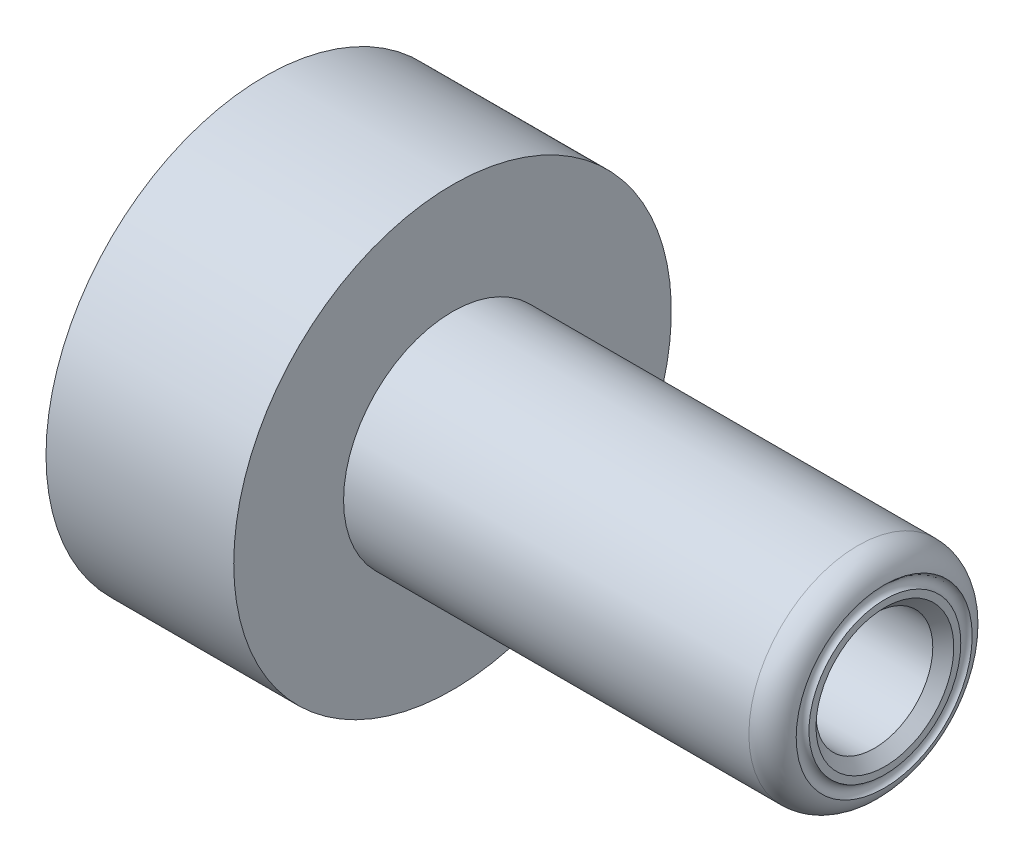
ISO-10303-21;
HEADER;
FILE_DESCRIPTION(('STEP AP214'),'2;1');
FILE_NAME('part.step','',(''),(''),'','','');
FILE_SCHEMA(('AUTOMOTIVE_DESIGN { 1 0 10303 214 1 1 1 1 }'));
ENDSEC;
DATA;
#1=APPLICATION_CONTEXT('core data for automotive mechanical design processes');
#2=APPLICATION_PROTOCOL_DEFINITION('international standard','automotive_design',2000,#1);
#3=PRODUCT_CONTEXT('',#1,'mechanical');
#4=PRODUCT('Part','Part','',(#3));
#5=PRODUCT_RELATED_PRODUCT_CATEGORY('part','',(#4));
#6=PRODUCT_DEFINITION_FORMATION('','',#4);
#7=PRODUCT_DEFINITION_CONTEXT('part definition',#1,'design');
#8=PRODUCT_DEFINITION('design','',#6,#7);
#9=PRODUCT_DEFINITION_SHAPE('','',#8);
#10=(LENGTH_UNIT() NAMED_UNIT(*) SI_UNIT(.MILLI.,.METRE.));
#11=(NAMED_UNIT(*) PLANE_ANGLE_UNIT() SI_UNIT($,.RADIAN.));
#12=(NAMED_UNIT(*) SI_UNIT($,.STERADIAN.) SOLID_ANGLE_UNIT());
#13=UNCERTAINTY_MEASURE_WITH_UNIT(LENGTH_MEASURE(1.E-05),#10,'distance_accuracy_value','');
#14=(GEOMETRIC_REPRESENTATION_CONTEXT(3) GLOBAL_UNCERTAINTY_ASSIGNED_CONTEXT((#13)) GLOBAL_UNIT_ASSIGNED_CONTEXT((#10,
#11,#12)) REPRESENTATION_CONTEXT('',''));
#15=CARTESIAN_POINT('',(0.,0.,0.));
#16=DIRECTION('',(0.,0.,1.));
#17=DIRECTION('',(1.,0.,0.));
#18=AXIS2_PLACEMENT_3D('',#15,#16,#17);
#19=CARTESIAN_POINT('',(35.9918,4.7546,0.));
#20=DIRECTION('',(-1.,0.,0.));
#21=DIRECTION('',(0.,0.,1.));
#22=AXIS2_PLACEMENT_3D('',#19,#20,#21);
#23=PLANE('',#22);
#24=CARTESIAN_POINT('',(35.9918,0.,0.));
#25=DIRECTION('',(-1.,0.,0.));
#26=DIRECTION('',(0.,0.,1.));
#27=AXIS2_PLACEMENT_3D('',#24,#25,#26);
#28=CIRCLE('',#27,4.);
#29=CARTESIAN_POINT('',(35.9918,0.,4.));
#30=VERTEX_POINT('',#29);
#31=EDGE_CURVE('E10',#30,#30,#28,.T.);
#32=ORIENTED_EDGE('',*,*,#31,.T.);
#33=EDGE_LOOP('',(#32));
#34=FACE_BOUND('',#33,.T.);
#35=CARTESIAN_POINT('',(35.9918,0.,0.));
#36=DIRECTION('',(1.,0.,0.));
#37=DIRECTION('',(0.,0.,-1.));
#38=AXIS2_PLACEMENT_3D('',#35,#36,#37);
#39=CIRCLE('',#38,4.40515842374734);
#40=CARTESIAN_POINT('',(35.9918,0.,-4.40515842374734));
#41=VERTEX_POINT('',#40);
#42=EDGE_CURVE('E77',#41,#41,#39,.F.);
#43=ORIENTED_EDGE('',*,*,#42,.F.);
#44=EDGE_LOOP('',(#43));
#45=FACE_BOUND('',#44,.T.);
#46=ADVANCED_FACE('F30',(#34,#45),#23,.F.);
#47=CARTESIAN_POINT('',(34.4218,0.,0.));
#48=DIRECTION('',(-1.,0.,0.));
#49=DIRECTION('',(0.,0.,1.));
#50=AXIS2_PLACEMENT_3D('',#47,#48,#49);
#51=TOROIDAL_SURFACE('',#50,4.7546,1.57);
#52=CARTESIAN_POINT('',(34.4218,0.,0.));
#53=DIRECTION('',(-1.,0.,0.));
#54=DIRECTION('',(0.,0.,1.));
#55=AXIS2_PLACEMENT_3D('',#52,#53,#54);
#56=CIRCLE('',#55,6.3246);
#57=CARTESIAN_POINT('',(34.4218,0.,6.3246));
#58=VERTEX_POINT('',#57);
#59=EDGE_CURVE('E47',#58,#58,#56,.T.);
#60=ORIENTED_EDGE('',*,*,#59,.F.);
#61=EDGE_LOOP('',(#60));
#62=FACE_BOUND('',#61,.T.);
#63=CARTESIAN_POINT('',(35.9514708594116,0.,0.));
#64=DIRECTION('',(1.,0.,0.));
#65=DIRECTION('',(0.,0.,-1.));
#66=AXIS2_PLACEMENT_3D('',#63,#64,#65);
#67=CIRCLE('',#66,5.10816337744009);
#68=CARTESIAN_POINT('',(35.9514708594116,0.,-5.10816337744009));
#69=VERTEX_POINT('',#68);
#70=EDGE_CURVE('E34',#69,#69,#67,.T.);
#71=ORIENTED_EDGE('',*,*,#70,.F.);
#72=EDGE_LOOP('',(#71));
#73=FACE_BOUND('',#72,.T.);
#74=ADVANCED_FACE('F86',(#62,#73),#51,.T.);
#75=CARTESIAN_POINT('',(0.,0.,0.));
#76=DIRECTION('',(-1.,0.,0.));
#77=DIRECTION('',(0.,0.,1.));
#78=AXIS2_PLACEMENT_3D('',#75,#76,#77);
#79=CYLINDRICAL_SURFACE('',#78,3.9751);
#80=CARTESIAN_POINT('',(21.8948,0.,0.));
#81=DIRECTION('',(-1.,0.,0.));
#82=DIRECTION('',(0.,0.,1.));
#83=AXIS2_PLACEMENT_3D('',#80,#81,#82);
#84=CIRCLE('',#83,3.9751);
#85=CARTESIAN_POINT('',(21.8948,0.,3.9751));
#86=VERTEX_POINT('',#85);
#87=EDGE_CURVE('E42',#86,#86,#84,.T.);
#88=ORIENTED_EDGE('',*,*,#87,.F.);
#89=EDGE_LOOP('',(#88));
#90=FACE_BOUND('',#89,.T.);
#91=CARTESIAN_POINT('',(0.,0.,0.));
#92=DIRECTION('',(-1.,0.,0.));
#93=DIRECTION('',(0.,0.,1.));
#94=AXIS2_PLACEMENT_3D('',#91,#92,#93);
#95=CIRCLE('',#94,3.9751);
#96=CARTESIAN_POINT('',(0.,0.,3.9751));
#97=VERTEX_POINT('',#96);
#98=EDGE_CURVE('E59',#97,#97,#95,.T.);
#99=ORIENTED_EDGE('',*,*,#98,.T.);
#100=EDGE_LOOP('',(#99));
#101=FACE_BOUND('',#100,.T.);
#102=ADVANCED_FACE('F88',(#90,#101),#79,.F.);
#103=CARTESIAN_POINT('',(21.8948,3.9751,0.));
#104=DIRECTION('',(1.,0.,0.));
#105=DIRECTION('',(0.,0.,-1.));
#106=AXIS2_PLACEMENT_3D('',#103,#104,#105);
#107=PLANE('',#106);
#108=CARTESIAN_POINT('',(21.8948,0.,0.));
#109=DIRECTION('',(1.,0.,0.));
#110=DIRECTION('',(0.,0.,-1.));
#111=AXIS2_PLACEMENT_3D('',#108,#109,#110);
#112=CIRCLE('',#111,3.39);
#113=CARTESIAN_POINT('',(21.8948,0.,-3.39));
#114=VERTEX_POINT('',#113);
#115=EDGE_CURVE('E72',#114,#114,#112,.T.);
#116=ORIENTED_EDGE('',*,*,#115,.T.);
#117=EDGE_LOOP('',(#116));
#118=FACE_BOUND('',#117,.T.);
#119=ORIENTED_EDGE('',*,*,#87,.T.);
#120=EDGE_LOOP('',(#119));
#121=FACE_BOUND('',#120,.T.);
#122=ADVANCED_FACE('F95',(#118,#121),#107,.F.);
#123=CARTESIAN_POINT('',(0.,0.,0.));
#124=DIRECTION('',(-1.,0.,0.));
#125=DIRECTION('',(0.,0.,1.));
#126=AXIS2_PLACEMENT_3D('',#123,#124,#125);
#127=CYLINDRICAL_SURFACE('',#126,6.3246);
#128=CARTESIAN_POINT('',(10.8966,0.,0.));
#129=DIRECTION('',(-1.,0.,0.));
#130=DIRECTION('',(0.,0.,1.));
#131=AXIS2_PLACEMENT_3D('',#128,#129,#130);
#132=CIRCLE('',#131,6.3246);
#133=CARTESIAN_POINT('',(10.8966,0.,6.3246));
#134=VERTEX_POINT('',#133);
#135=EDGE_CURVE('E50',#134,#134,#132,.T.);
#136=ORIENTED_EDGE('',*,*,#135,.F.);
#137=EDGE_LOOP('',(#136));
#138=FACE_BOUND('',#137,.T.);
#139=ORIENTED_EDGE('',*,*,#59,.T.);
#140=EDGE_LOOP('',(#139));
#141=FACE_BOUND('',#140,.T.);
#142=ADVANCED_FACE('F100',(#138,#141),#127,.T.);
#143=CARTESIAN_POINT('',(10.8966,12.7,0.));
#144=DIRECTION('',(-1.,0.,0.));
#145=DIRECTION('',(0.,0.,1.));
#146=AXIS2_PLACEMENT_3D('',#143,#144,#145);
#147=PLANE('',#146);
#148=CARTESIAN_POINT('',(10.8966,0.,0.));
#149=DIRECTION('',(-1.,0.,0.));
#150=DIRECTION('',(0.,0.,1.));
#151=AXIS2_PLACEMENT_3D('',#148,#149,#150);
#152=CIRCLE('',#151,12.7);
#153=CARTESIAN_POINT('',(10.8966,0.,12.7));
#154=VERTEX_POINT('',#153);
#155=EDGE_CURVE('E53',#154,#154,#152,.T.);
#156=ORIENTED_EDGE('',*,*,#155,.F.);
#157=EDGE_LOOP('',(#156));
#158=FACE_BOUND('',#157,.T.);
#159=ORIENTED_EDGE('',*,*,#135,.T.);
#160=EDGE_LOOP('',(#159));
#161=FACE_BOUND('',#160,.T.);
#162=ADVANCED_FACE('F108',(#158,#161),#147,.F.);
#163=CARTESIAN_POINT('',(0.,0.,0.));
#164=DIRECTION('',(-1.,0.,0.));
#165=DIRECTION('',(0.,0.,1.));
#166=AXIS2_PLACEMENT_3D('',#163,#164,#165);
#167=CYLINDRICAL_SURFACE('',#166,12.7);
#168=CARTESIAN_POINT('',(0.,0.,0.));
#169=DIRECTION('',(-1.,0.,0.));
#170=DIRECTION('',(0.,0.,1.));
#171=AXIS2_PLACEMENT_3D('',#168,#169,#170);
#172=CIRCLE('',#171,12.7);
#173=CARTESIAN_POINT('',(0.,0.,12.7));
#174=VERTEX_POINT('',#173);
#175=EDGE_CURVE('E56',#174,#174,#172,.T.);
#176=ORIENTED_EDGE('',*,*,#175,.F.);
#177=EDGE_LOOP('',(#176));
#178=FACE_BOUND('',#177,.T.);
#179=ORIENTED_EDGE('',*,*,#155,.T.);
#180=EDGE_LOOP('',(#179));
#181=FACE_BOUND('',#180,.T.);
#182=ADVANCED_FACE('F120',(#178,#181),#167,.T.);
#183=CARTESIAN_POINT('',(0.,3.9751,0.));
#184=DIRECTION('',(1.,0.,0.));
#185=DIRECTION('',(0.,0.,-1.));
#186=AXIS2_PLACEMENT_3D('',#183,#184,#185);
#187=PLANE('',#186);
#188=CARTESIAN_POINT('',(0.,0.,7.1374));
#189=DIRECTION('',(-1.,0.,0.));
#190=DIRECTION('',(0.,0.,-1.));
#191=AXIS2_PLACEMENT_3D('',#188,#189,#190);
#192=CIRCLE('',#191,1.6129);
#193=CARTESIAN_POINT('',(0.,0.,5.5245));
#194=VERTEX_POINT('',#193);
#195=EDGE_CURVE('E69',#194,#194,#192,.T.);
#196=ORIENTED_EDGE('',*,*,#195,.F.);
#197=EDGE_LOOP('',(#196));
#198=FACE_BOUND('',#197,.T.);
#199=CARTESIAN_POINT('',(0.,0.,-7.1374));
#200=DIRECTION('',(-1.,0.,0.));
#201=DIRECTION('',(0.,0.,1.));
#202=AXIS2_PLACEMENT_3D('',#199,#200,#201);
#203=CIRCLE('',#202,1.6129);
#204=CARTESIAN_POINT('',(0.,0.,-5.5245));
#205=VERTEX_POINT('',#204);
#206=EDGE_CURVE('E63',#205,#205,#203,.T.);
#207=ORIENTED_EDGE('',*,*,#206,.F.);
#208=EDGE_LOOP('',(#207));
#209=FACE_BOUND('',#208,.T.);
#210=ORIENTED_EDGE('',*,*,#98,.F.);
#211=EDGE_LOOP('',(#210));
#212=FACE_BOUND('',#211,.T.);
#213=ORIENTED_EDGE('',*,*,#175,.T.);
#214=EDGE_LOOP('',(#213));
#215=FACE_BOUND('',#214,.T.);
#216=ADVANCED_FACE('F116',(#198,#209,#212,#215),#187,.F.);
#217=CARTESIAN_POINT('',(6.35,0.,-7.1374));
#218=DIRECTION('',(-1.,0.,0.));
#219=DIRECTION('',(0.,0.,1.));
#220=AXIS2_PLACEMENT_3D('',#217,#218,#219);
#221=CYLINDRICAL_SURFACE('',#220,1.6129);
#222=CARTESIAN_POINT('',(6.35,0.,-7.1374));
#223=DIRECTION('',(-1.,0.,0.));
#224=DIRECTION('',(0.,0.,1.));
#225=AXIS2_PLACEMENT_3D('',#222,#223,#224);
#226=CIRCLE('',#225,1.6129);
#227=CARTESIAN_POINT('',(6.35,0.,-5.5245));
#228=VERTEX_POINT('',#227);
#229=EDGE_CURVE('E62',#228,#228,#226,.T.);
#230=ORIENTED_EDGE('',*,*,#229,.F.);
#231=EDGE_LOOP('',(#230));
#232=FACE_BOUND('',#231,.T.);
#233=ORIENTED_EDGE('',*,*,#206,.T.);
#234=EDGE_LOOP('',(#233));
#235=FACE_BOUND('',#234,.T.);
#236=ADVANCED_FACE('F119',(#232,#235),#221,.F.);
#237=CARTESIAN_POINT('',(6.35,0.,-7.1374));
#238=DIRECTION('',(-1.,0.,0.));
#239=DIRECTION('',(0.,0.,1.));
#240=AXIS2_PLACEMENT_3D('',#237,#238,#239);
#241=PLANE('',#240);
#242=ORIENTED_EDGE('',*,*,#229,.T.);
#243=EDGE_LOOP('',(#242));
#244=FACE_BOUND('',#243,.T.);
#245=ADVANCED_FACE('F139',(#244),#241,.T.);
#246=CARTESIAN_POINT('',(6.35,0.,7.1374));
#247=DIRECTION('',(-1.,0.,0.));
#248=DIRECTION('',(0.,0.,1.));
#249=AXIS2_PLACEMENT_3D('',#246,#247,#248);
#250=CYLINDRICAL_SURFACE('',#249,1.6129);
#251=CARTESIAN_POINT('',(6.35,0.,7.1374));
#252=DIRECTION('',(-1.,0.,0.));
#253=DIRECTION('',(0.,0.,-1.));
#254=AXIS2_PLACEMENT_3D('',#251,#252,#253);
#255=CIRCLE('',#254,1.6129);
#256=CARTESIAN_POINT('',(6.35,0.,5.5245));
#257=VERTEX_POINT('',#256);
#258=EDGE_CURVE('E66',#257,#257,#255,.T.);
#259=ORIENTED_EDGE('',*,*,#258,.F.);
#260=EDGE_LOOP('',(#259));
#261=FACE_BOUND('',#260,.T.);
#262=ORIENTED_EDGE('',*,*,#195,.T.);
#263=EDGE_LOOP('',(#262));
#264=FACE_BOUND('',#263,.T.);
#265=ADVANCED_FACE('F143',(#261,#264),#250,.F.);
#266=CARTESIAN_POINT('',(6.35,0.,7.1374));
#267=DIRECTION('',(1.,0.,0.));
#268=DIRECTION('',(0.,0.,-1.));
#269=AXIS2_PLACEMENT_3D('',#266,#267,#268);
#270=PLANE('',#269);
#271=ORIENTED_EDGE('',*,*,#258,.T.);
#272=EDGE_LOOP('',(#271));
#273=FACE_BOUND('',#272,.T.);
#274=ADVANCED_FACE('F147',(#273),#270,.F.);
#275=CARTESIAN_POINT('',(0.,0.,0.));
#276=DIRECTION('',(1.,0.,0.));
#277=DIRECTION('',(0.,0.,-1.));
#278=AXIS2_PLACEMENT_3D('',#275,#276,#277);
#279=CYLINDRICAL_SURFACE('',#278,3.39);
#280=CARTESIAN_POINT('',(35.3818,0.,0.));
#281=DIRECTION('',(-1.,0.,0.));
#282=DIRECTION('',(0.,0.,1.));
#283=AXIS2_PLACEMENT_3D('',#280,#281,#282);
#284=CIRCLE('',#283,3.39);
#285=CARTESIAN_POINT('',(35.3818,0.,3.39));
#286=VERTEX_POINT('',#285);
#287=EDGE_CURVE('E38',#286,#286,#284,.F.);
#288=ORIENTED_EDGE('',*,*,#287,.T.);
#289=EDGE_LOOP('',(#288));
#290=FACE_BOUND('',#289,.T.);
#291=ORIENTED_EDGE('',*,*,#115,.F.);
#292=EDGE_LOOP('',(#291));
#293=FACE_BOUND('',#292,.T.);
#294=ADVANCED_FACE('F151',(#290,#293),#279,.F.);
#295=CARTESIAN_POINT('',(35.3818,0.,0.));
#296=DIRECTION('',(1.,0.,0.));
#297=DIRECTION('',(0.,0.,-1.));
#298=AXIS2_PLACEMENT_3D('',#295,#296,#297);
#299=CONICAL_SURFACE('',#298,3.39,0.785398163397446);
#300=ORIENTED_EDGE('',*,*,#31,.F.);
#301=EDGE_LOOP('',(#300));
#302=FACE_BOUND('',#301,.T.);
#303=ORIENTED_EDGE('',*,*,#287,.F.);
#304=EDGE_LOOP('',(#303));
#305=FACE_BOUND('',#304,.T.);
#306=ADVANCED_FACE('F32',(#302,#305),#299,.F.);
#307=CARTESIAN_POINT('',(36.117,0.,0.));
#308=DIRECTION('',(-1.,0.,0.));
#309=DIRECTION('',(0.,0.,1.));
#310=AXIS2_PLACEMENT_3D('',#307,#308,#309);
#311=TOROIDAL_SURFACE('',#310,4.765,0.381000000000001);
#312=ORIENTED_EDGE('',*,*,#70,.T.);
#313=EDGE_LOOP('',(#312));
#314=FACE_BOUND('',#313,.T.);
#315=ORIENTED_EDGE('',*,*,#42,.T.);
#316=EDGE_LOOP('',(#315));
#317=FACE_BOUND('',#316,.T.);
#318=ADVANCED_FACE('F84',(#314,#317),#311,.F.);
#319=CLOSED_SHELL('',(#46,#74,#102,#122,#142,#162,#182,#216,#236,#245,#265,#274,#294,#306,#318));
#320=MANIFOLD_SOLID_BREP('B2',#319);
#321=ADVANCED_BREP_SHAPE_REPRESENTATION('',(#18,#320),#14);
#322=SHAPE_DEFINITION_REPRESENTATION(#9,#321);
ENDSEC;
END-ISO-10303-21;
